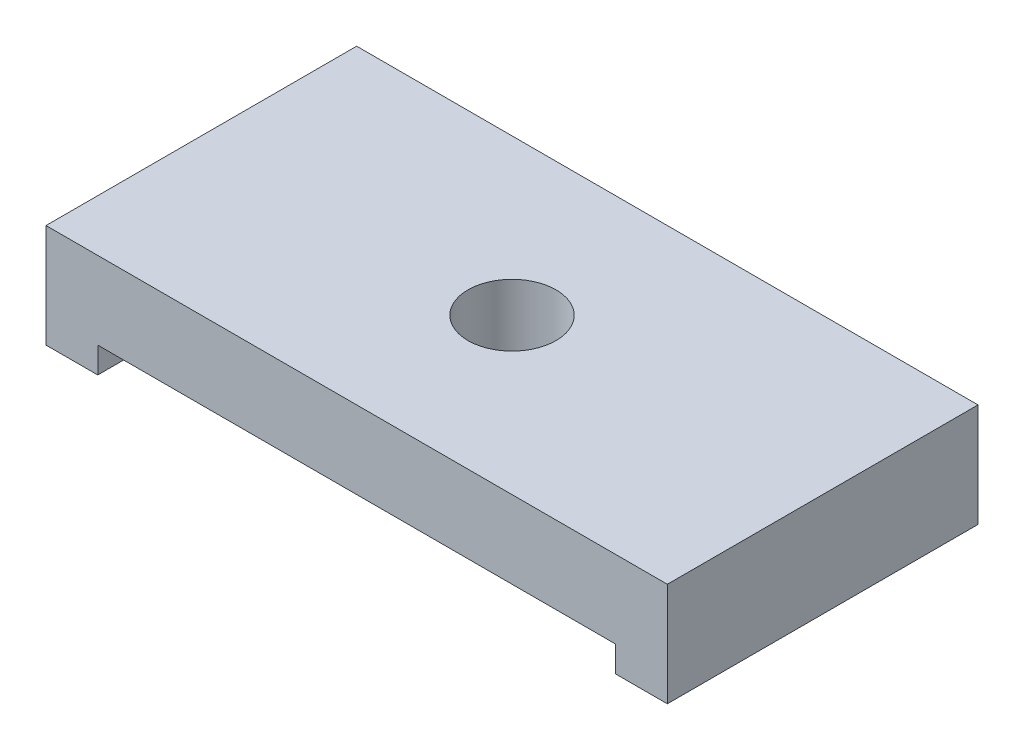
ISO-10303-21;
HEADER;
FILE_DESCRIPTION(('STEP AP214'),'2;1');
FILE_NAME('part.step','',(''),(''),'','','');
FILE_SCHEMA(('AUTOMOTIVE_DESIGN { 1 0 10303 214 1 1 1 1 }'));
ENDSEC;
DATA;
#1=APPLICATION_CONTEXT('core data for automotive mechanical design processes');
#2=APPLICATION_PROTOCOL_DEFINITION('international standard','automotive_design',2000,#1);
#3=PRODUCT_CONTEXT('',#1,'mechanical');
#4=PRODUCT('Part','Part','',(#3));
#5=PRODUCT_RELATED_PRODUCT_CATEGORY('part','',(#4));
#6=PRODUCT_DEFINITION_FORMATION('','',#4);
#7=PRODUCT_DEFINITION_CONTEXT('part definition',#1,'design');
#8=PRODUCT_DEFINITION('design','',#6,#7);
#9=PRODUCT_DEFINITION_SHAPE('','',#8);
#10=(LENGTH_UNIT() NAMED_UNIT(*) SI_UNIT(.MILLI.,.METRE.));
#11=(NAMED_UNIT(*) PLANE_ANGLE_UNIT() SI_UNIT($,.RADIAN.));
#12=(NAMED_UNIT(*) SI_UNIT($,.STERADIAN.) SOLID_ANGLE_UNIT());
#13=UNCERTAINTY_MEASURE_WITH_UNIT(LENGTH_MEASURE(1.E-05),#10,'distance_accuracy_value','');
#14=(GEOMETRIC_REPRESENTATION_CONTEXT(3) GLOBAL_UNCERTAINTY_ASSIGNED_CONTEXT((#13)) GLOBAL_UNIT_ASSIGNED_CONTEXT((#10,
#11,#12)) REPRESENTATION_CONTEXT('',''));
#15=CARTESIAN_POINT('',(0.,0.,0.));
#16=DIRECTION('',(0.,0.,1.));
#17=DIRECTION('',(1.,0.,0.));
#18=AXIS2_PLACEMENT_3D('',#15,#16,#17);
#19=CARTESIAN_POINT('',(0.,0.,30.));
#20=DIRECTION('',(0.,1.,0.));
#21=DIRECTION('',(0.,0.,1.));
#22=AXIS2_PLACEMENT_3D('',#19,#20,#21);
#23=PLANE('',#22);
#24=DIRECTION('',(1.,0.,0.));
#25=VECTOR('',#24,1.);
#26=CARTESIAN_POINT('',(0.,0.,0.));
#27=LINE('',#26,#25);
#28=CARTESIAN_POINT('',(0.,0.,0.));
#29=VERTEX_POINT('',#28);
#30=CARTESIAN_POINT('',(5.,0.,0.));
#31=VERTEX_POINT('',#30);
#32=EDGE_CURVE('E123',#29,#31,#27,.T.);
#33=ORIENTED_EDGE('',*,*,#32,.T.);
#34=DIRECTION('',(0.,0.,1.));
#35=VECTOR('',#34,1.);
#36=CARTESIAN_POINT('',(5.,0.,0.));
#37=LINE('',#36,#35);
#38=CARTESIAN_POINT('',(5.,0.,29.9999999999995));
#39=VERTEX_POINT('',#38);
#40=EDGE_CURVE('E110',#31,#39,#37,.T.);
#41=ORIENTED_EDGE('',*,*,#40,.T.);
#42=DIRECTION('',(1.,0.,0.));
#43=VECTOR('',#42,1.);
#44=CARTESIAN_POINT('',(0.,0.,30.));
#45=LINE('',#44,#43);
#46=CARTESIAN_POINT('',(0.,0.,30.));
#47=VERTEX_POINT('',#46);
#48=EDGE_CURVE('E122',#47,#39,#45,.T.);
#49=ORIENTED_EDGE('',*,*,#48,.F.);
#50=DIRECTION('',(0.,0.,-1.));
#51=VECTOR('',#50,1.);
#52=CARTESIAN_POINT('',(0.,0.,30.));
#53=LINE('',#52,#51);
#54=EDGE_CURVE('E11',#47,#29,#53,.T.);
#55=ORIENTED_EDGE('',*,*,#54,.T.);
#56=EDGE_LOOP('',(#33,#41,#49,#55));
#57=FACE_BOUND('',#56,.T.);
#58=ADVANCED_FACE('F40',(#57),#23,.F.);
#59=CARTESIAN_POINT('',(0.,0.,30.));
#60=DIRECTION('',(1.,0.,0.));
#61=DIRECTION('',(0.,0.,-1.));
#62=AXIS2_PLACEMENT_3D('',#59,#60,#61);
#63=PLANE('',#62);
#64=DIRECTION('',(0.,-1.,0.));
#65=VECTOR('',#64,1.);
#66=CARTESIAN_POINT('',(0.,0.,0.));
#67=LINE('',#66,#65);
#68=CARTESIAN_POINT('',(0.,10.,0.));
#69=VERTEX_POINT('',#68);
#70=EDGE_CURVE('E177',#69,#29,#67,.T.);
#71=ORIENTED_EDGE('',*,*,#70,.T.);
#72=ORIENTED_EDGE('',*,*,#54,.F.);
#73=DIRECTION('',(0.,-1.,0.));
#74=VECTOR('',#73,1.);
#75=CARTESIAN_POINT('',(0.,0.,30.));
#76=LINE('',#75,#74);
#77=CARTESIAN_POINT('',(0.,10.,30.));
#78=VERTEX_POINT('',#77);
#79=EDGE_CURVE('E129',#78,#47,#76,.T.);
#80=ORIENTED_EDGE('',*,*,#79,.F.);
#81=DIRECTION('',(0.,0.,-1.));
#82=VECTOR('',#81,1.);
#83=CARTESIAN_POINT('',(0.,10.,30.));
#84=LINE('',#83,#82);
#85=EDGE_CURVE('E145',#78,#69,#84,.T.);
#86=ORIENTED_EDGE('',*,*,#85,.T.);
#87=EDGE_LOOP('',(#71,#72,#80,#86));
#88=FACE_BOUND('',#87,.T.);
#89=ADVANCED_FACE('F42',(#88),#63,.F.);
#90=CARTESIAN_POINT('',(55.,0.,30.));
#91=VERTEX_POINT('',#90);
#92=CARTESIAN_POINT('',(60.,0.,29.9999999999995));
#93=VERTEX_POINT('',#92);
#94=EDGE_CURVE('E133',#91,#93,#45,.T.);
#95=ORIENTED_EDGE('',*,*,#94,.F.);
#96=DIRECTION('',(0.,0.,1.));
#97=VECTOR('',#96,1.);
#98=CARTESIAN_POINT('',(55.,0.,-9.43689570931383E-13));
#99=LINE('',#98,#97);
#100=CARTESIAN_POINT('',(55.,0.,-9.43689570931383E-13));
#101=VERTEX_POINT('',#100);
#102=EDGE_CURVE('E125',#101,#91,#99,.T.);
#103=ORIENTED_EDGE('',*,*,#102,.F.);
#104=CARTESIAN_POINT('',(60.,0.,0.));
#105=VERTEX_POINT('',#104);
#106=EDGE_CURVE('E168',#101,#105,#27,.T.);
#107=ORIENTED_EDGE('',*,*,#106,.T.);
#108=DIRECTION('',(0.,0.,-1.));
#109=VECTOR('',#108,1.);
#110=CARTESIAN_POINT('',(60.,0.,29.9999999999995));
#111=LINE('',#110,#109);
#112=EDGE_CURVE('E49',#93,#105,#111,.T.);
#113=ORIENTED_EDGE('',*,*,#112,.F.);
#114=EDGE_LOOP('',(#95,#103,#107,#113));
#115=FACE_BOUND('',#114,.T.);
#116=ADVANCED_FACE('F220',(#115),#23,.F.);
#117=CARTESIAN_POINT('',(60.,0.,29.9999999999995));
#118=DIRECTION('',(-1.,0.,0.));
#119=DIRECTION('',(0.,0.,1.));
#120=AXIS2_PLACEMENT_3D('',#117,#118,#119);
#121=PLANE('',#120);
#122=DIRECTION('',(0.,1.,0.));
#123=VECTOR('',#122,1.);
#124=CARTESIAN_POINT('',(60.,0.,0.));
#125=LINE('',#124,#123);
#126=CARTESIAN_POINT('',(60.,10.,0.));
#127=VERTEX_POINT('',#126);
#128=EDGE_CURVE('E160',#105,#127,#125,.T.);
#129=ORIENTED_EDGE('',*,*,#128,.T.);
#130=DIRECTION('',(0.,0.,-1.));
#131=VECTOR('',#130,1.);
#132=CARTESIAN_POINT('',(60.,10.,29.9999999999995));
#133=LINE('',#132,#131);
#134=CARTESIAN_POINT('',(60.,10.,29.9999999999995));
#135=VERTEX_POINT('',#134);
#136=EDGE_CURVE('E149',#135,#127,#133,.T.);
#137=ORIENTED_EDGE('',*,*,#136,.F.);
#138=DIRECTION('',(0.,1.,0.));
#139=VECTOR('',#138,1.);
#140=CARTESIAN_POINT('',(60.,0.,29.9999999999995));
#141=LINE('',#140,#139);
#142=EDGE_CURVE('E132',#93,#135,#141,.T.);
#143=ORIENTED_EDGE('',*,*,#142,.F.);
#144=ORIENTED_EDGE('',*,*,#112,.T.);
#145=EDGE_LOOP('',(#129,#137,#143,#144));
#146=FACE_BOUND('',#145,.T.);
#147=ADVANCED_FACE('F158',(#146),#121,.F.);
#148=CARTESIAN_POINT('',(0.,10.,30.));
#149=DIRECTION('',(0.,-1.,0.));
#150=DIRECTION('',(0.,0.,-1.));
#151=AXIS2_PLACEMENT_3D('',#148,#149,#150);
#152=PLANE('',#151);
#153=CARTESIAN_POINT('',(30.,10.,15.));
#154=DIRECTION('',(0.,1.,0.));
#155=DIRECTION('',(0.,0.,1.));
#156=AXIS2_PLACEMENT_3D('',#153,#154,#155);
#157=CIRCLE('',#156,4.25);
#158=CARTESIAN_POINT('',(30.,10.,19.25));
#159=VERTEX_POINT('',#158);
#160=EDGE_CURVE('E203',#159,#159,#157,.T.);
#161=ORIENTED_EDGE('',*,*,#160,.F.);
#162=EDGE_LOOP('',(#161));
#163=FACE_BOUND('',#162,.T.);
#164=DIRECTION('',(-1.,0.,0.));
#165=VECTOR('',#164,1.);
#166=CARTESIAN_POINT('',(0.,10.,0.));
#167=LINE('',#166,#165);
#168=EDGE_CURVE('E170',#127,#69,#167,.T.);
#169=ORIENTED_EDGE('',*,*,#168,.T.);
#170=ORIENTED_EDGE('',*,*,#85,.F.);
#171=DIRECTION('',(-1.,0.,0.));
#172=VECTOR('',#171,1.);
#173=CARTESIAN_POINT('',(0.,10.,30.));
#174=LINE('',#173,#172);
#175=EDGE_CURVE('E64',#135,#78,#174,.T.);
#176=ORIENTED_EDGE('',*,*,#175,.F.);
#177=ORIENTED_EDGE('',*,*,#136,.T.);
#178=EDGE_LOOP('',(#169,#170,#176,#177));
#179=FACE_BOUND('',#178,.T.);
#180=ADVANCED_FACE('F211',(#163,#179),#152,.F.);
#181=CARTESIAN_POINT('',(0.,10.,30.));
#182=DIRECTION('',(0.,0.,-1.));
#183=DIRECTION('',(-1.,0.,0.));
#184=AXIS2_PLACEMENT_3D('',#181,#182,#183);
#185=PLANE('',#184);
#186=ORIENTED_EDGE('',*,*,#48,.T.);
#187=DIRECTION('',(0.,-1.,0.));
#188=VECTOR('',#187,1.);
#189=CARTESIAN_POINT('',(5.,0.,29.9999999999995));
#190=LINE('',#189,#188);
#191=CARTESIAN_POINT('',(5.,2.50000000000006,29.9999999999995));
#192=VERTEX_POINT('',#191);
#193=EDGE_CURVE('E106',#192,#39,#190,.T.);
#194=ORIENTED_EDGE('',*,*,#193,.F.);
#195=DIRECTION('',(-1.,0.,0.));
#196=VECTOR('',#195,1.);
#197=CARTESIAN_POINT('',(5.,2.50000000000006,29.9999999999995));
#198=LINE('',#197,#196);
#199=CARTESIAN_POINT('',(55.,2.50000000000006,30.));
#200=VERTEX_POINT('',#199);
#201=EDGE_CURVE('E196',#200,#192,#198,.T.);
#202=ORIENTED_EDGE('',*,*,#201,.F.);
#203=DIRECTION('',(0.,1.,0.));
#204=VECTOR('',#203,1.);
#205=CARTESIAN_POINT('',(55.,0.,30.));
#206=LINE('',#205,#204);
#207=EDGE_CURVE('E117',#91,#200,#206,.T.);
#208=ORIENTED_EDGE('',*,*,#207,.F.);
#209=ORIENTED_EDGE('',*,*,#94,.T.);
#210=ORIENTED_EDGE('',*,*,#142,.T.);
#211=ORIENTED_EDGE('',*,*,#175,.T.);
#212=ORIENTED_EDGE('',*,*,#79,.T.);
#213=EDGE_LOOP('',(#186,#194,#202,#208,#209,#210,#211,#212));
#214=FACE_BOUND('',#213,.T.);
#215=ADVANCED_FACE('F127',(#214),#185,.F.);
#216=CARTESIAN_POINT('',(0.,10.,0.));
#217=DIRECTION('',(0.,0.,-1.));
#218=DIRECTION('',(-1.,0.,0.));
#219=AXIS2_PLACEMENT_3D('',#216,#217,#218);
#220=PLANE('',#219);
#221=DIRECTION('',(0.,-1.,0.));
#222=VECTOR('',#221,1.);
#223=CARTESIAN_POINT('',(5.,0.,0.));
#224=LINE('',#223,#222);
#225=CARTESIAN_POINT('',(5.,2.49999999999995,0.));
#226=VERTEX_POINT('',#225);
#227=EDGE_CURVE('E193',#226,#31,#224,.T.);
#228=ORIENTED_EDGE('',*,*,#227,.T.);
#229=ORIENTED_EDGE('',*,*,#32,.F.);
#230=ORIENTED_EDGE('',*,*,#70,.F.);
#231=ORIENTED_EDGE('',*,*,#168,.F.);
#232=ORIENTED_EDGE('',*,*,#128,.F.);
#233=ORIENTED_EDGE('',*,*,#106,.F.);
#234=DIRECTION('',(0.,1.,0.));
#235=VECTOR('',#234,1.);
#236=CARTESIAN_POINT('',(55.,0.,-9.43689570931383E-13));
#237=LINE('',#236,#235);
#238=CARTESIAN_POINT('',(55.,2.50000000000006,-9.43689570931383E-13));
#239=VERTEX_POINT('',#238);
#240=EDGE_CURVE('E190',#101,#239,#237,.T.);
#241=ORIENTED_EDGE('',*,*,#240,.T.);
#242=DIRECTION('',(-1.,0.,0.));
#243=VECTOR('',#242,1.);
#244=CARTESIAN_POINT('',(5.,2.49999999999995,0.));
#245=LINE('',#244,#243);
#246=EDGE_CURVE('E56',#239,#226,#245,.T.);
#247=ORIENTED_EDGE('',*,*,#246,.T.);
#248=EDGE_LOOP('',(#228,#229,#230,#231,#232,#233,#241,#247));
#249=FACE_BOUND('',#248,.T.);
#250=ADVANCED_FACE('F166',(#249),#220,.T.);
#251=CARTESIAN_POINT('',(5.,0.,0.));
#252=DIRECTION('',(-1.,0.,0.));
#253=DIRECTION('',(0.,0.,1.));
#254=AXIS2_PLACEMENT_3D('',#251,#252,#253);
#255=PLANE('',#254);
#256=ORIENTED_EDGE('',*,*,#193,.T.);
#257=ORIENTED_EDGE('',*,*,#40,.F.);
#258=ORIENTED_EDGE('',*,*,#227,.F.);
#259=DIRECTION('',(0.,0.,1.));
#260=VECTOR('',#259,1.);
#261=CARTESIAN_POINT('',(5.,2.49999999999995,0.));
#262=LINE('',#261,#260);
#263=EDGE_CURVE('E112',#226,#192,#262,.T.);
#264=ORIENTED_EDGE('',*,*,#263,.T.);
#265=EDGE_LOOP('',(#256,#257,#258,#264));
#266=FACE_BOUND('',#265,.T.);
#267=ADVANCED_FACE('F108',(#266),#255,.F.);
#268=CARTESIAN_POINT('',(5.,2.49999999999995,0.));
#269=DIRECTION('',(0.,1.,0.));
#270=DIRECTION('',(0.,0.,1.));
#271=AXIS2_PLACEMENT_3D('',#268,#269,#270);
#272=PLANE('',#271);
#273=CARTESIAN_POINT('',(30.,2.50000000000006,15.));
#274=DIRECTION('',(0.,1.,0.));
#275=DIRECTION('',(0.,0.,1.));
#276=AXIS2_PLACEMENT_3D('',#273,#274,#275);
#277=CIRCLE('',#276,4.25);
#278=CARTESIAN_POINT('',(30.,2.50000000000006,19.25));
#279=VERTEX_POINT('',#278);
#280=EDGE_CURVE('E118',#279,#279,#277,.T.);
#281=ORIENTED_EDGE('',*,*,#280,.T.);
#282=EDGE_LOOP('',(#281));
#283=FACE_BOUND('',#282,.T.);
#284=ORIENTED_EDGE('',*,*,#201,.T.);
#285=ORIENTED_EDGE('',*,*,#263,.F.);
#286=ORIENTED_EDGE('',*,*,#246,.F.);
#287=DIRECTION('',(0.,0.,1.));
#288=VECTOR('',#287,1.);
#289=CARTESIAN_POINT('',(55.,2.50000000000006,-9.43689570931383E-13));
#290=LINE('',#289,#288);
#291=EDGE_CURVE('E183',#239,#200,#290,.T.);
#292=ORIENTED_EDGE('',*,*,#291,.T.);
#293=EDGE_LOOP('',(#284,#285,#286,#292));
#294=FACE_BOUND('',#293,.T.);
#295=ADVANCED_FACE('F221',(#283,#294),#272,.F.);
#296=CARTESIAN_POINT('',(55.,0.,-9.43689570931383E-13));
#297=DIRECTION('',(1.,0.,0.));
#298=DIRECTION('',(0.,1.,0.));
#299=AXIS2_PLACEMENT_3D('',#296,#297,#298);
#300=PLANE('',#299);
#301=ORIENTED_EDGE('',*,*,#207,.T.);
#302=ORIENTED_EDGE('',*,*,#291,.F.);
#303=ORIENTED_EDGE('',*,*,#240,.F.);
#304=ORIENTED_EDGE('',*,*,#102,.T.);
#305=EDGE_LOOP('',(#301,#302,#303,#304));
#306=FACE_BOUND('',#305,.T.);
#307=ADVANCED_FACE('F218',(#306),#300,.F.);
#308=CARTESIAN_POINT('',(30.,10.,15.));
#309=DIRECTION('',(0.,1.,0.));
#310=DIRECTION('',(0.,0.,1.));
#311=AXIS2_PLACEMENT_3D('',#308,#309,#310);
#312=CYLINDRICAL_SURFACE('',#311,4.25);
#313=ORIENTED_EDGE('',*,*,#160,.T.);
#314=EDGE_LOOP('',(#313));
#315=FACE_BOUND('',#314,.T.);
#316=ORIENTED_EDGE('',*,*,#280,.F.);
#317=EDGE_LOOP('',(#316));
#318=FACE_BOUND('',#317,.T.);
#319=ADVANCED_FACE('F208',(#315,#318),#312,.F.);
#320=CLOSED_SHELL('',(#58,#89,#116,#147,#180,#215,#250,#267,#295,#307,#319));
#321=MANIFOLD_SOLID_BREP('B2',#320);
#322=ADVANCED_BREP_SHAPE_REPRESENTATION('',(#18,#321),#14);
#323=SHAPE_DEFINITION_REPRESENTATION(#9,#322);
ENDSEC;
END-ISO-10303-21;
